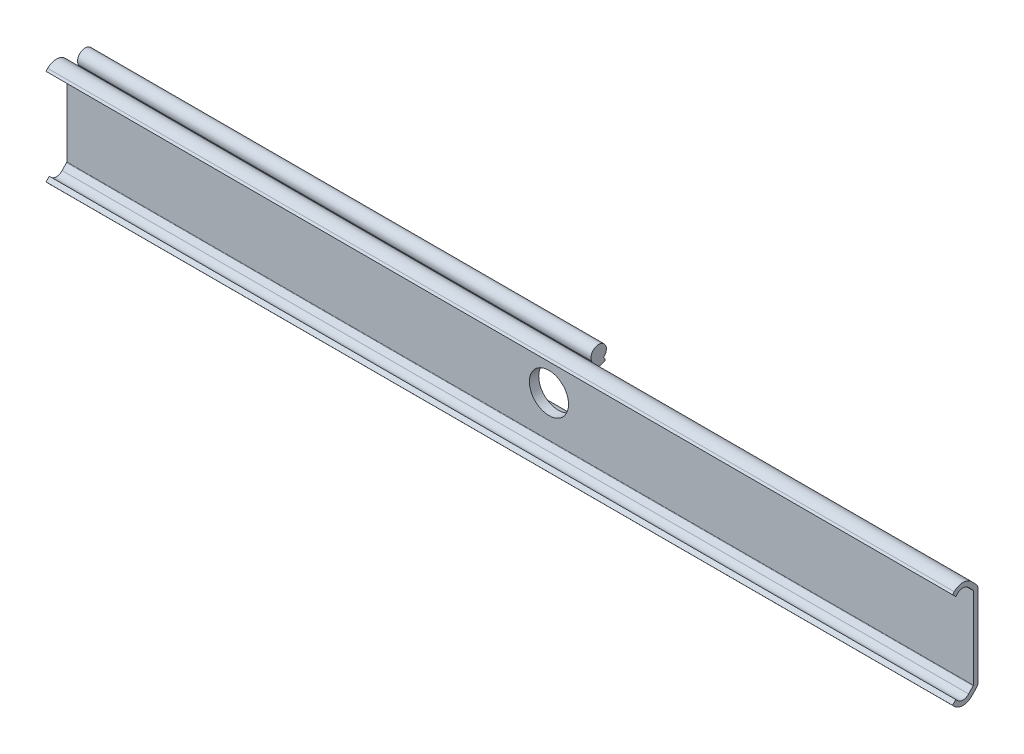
ISO-10303-21;
HEADER;
FILE_DESCRIPTION(('STEP AP214'),'2;1');
FILE_NAME('part.step','',(''),(''),'','','');
FILE_SCHEMA(('AUTOMOTIVE_DESIGN { 1 0 10303 214 1 1 1 1 }'));
ENDSEC;
DATA;
#1=APPLICATION_CONTEXT('core data for automotive mechanical design processes');
#2=APPLICATION_PROTOCOL_DEFINITION('international standard','automotive_design',2000,#1);
#3=PRODUCT_CONTEXT('',#1,'mechanical');
#4=PRODUCT('Part','Part','',(#3));
#5=PRODUCT_RELATED_PRODUCT_CATEGORY('part','',(#4));
#6=PRODUCT_DEFINITION_FORMATION('','',#4);
#7=PRODUCT_DEFINITION_CONTEXT('part definition',#1,'design');
#8=PRODUCT_DEFINITION('design','',#6,#7);
#9=PRODUCT_DEFINITION_SHAPE('','',#8);
#10=(LENGTH_UNIT() NAMED_UNIT(*) SI_UNIT(.MILLI.,.METRE.));
#11=(NAMED_UNIT(*) PLANE_ANGLE_UNIT() SI_UNIT($,.RADIAN.));
#12=(NAMED_UNIT(*) SI_UNIT($,.STERADIAN.) SOLID_ANGLE_UNIT());
#13=UNCERTAINTY_MEASURE_WITH_UNIT(LENGTH_MEASURE(1.E-05),#10,'distance_accuracy_value','');
#14=(GEOMETRIC_REPRESENTATION_CONTEXT(3) GLOBAL_UNCERTAINTY_ASSIGNED_CONTEXT((#13)) GLOBAL_UNIT_ASSIGNED_CONTEXT((#10,
#11,#12)) REPRESENTATION_CONTEXT('',''));
#15=CARTESIAN_POINT('',(0.,0.,0.));
#16=DIRECTION('',(0.,0.,1.));
#17=DIRECTION('',(1.,0.,0.));
#18=AXIS2_PLACEMENT_3D('',#15,#16,#17);
#19=CARTESIAN_POINT('',(300.8,13.561018,0.));
#20=DIRECTION('',(0.,0.,-1.));
#21=DIRECTION('',(-1.,0.,0.));
#22=AXIS2_PLACEMENT_3D('',#19,#20,#21);
#23=PLANE('',#22);
#24=DIRECTION('',(0.,-1.,0.));
#25=VECTOR('',#24,1.);
#26=CARTESIAN_POINT('',(0.,13.561018,0.));
#27=LINE('',#26,#25);
#28=CARTESIAN_POINT('',(0.,-10.7622239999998,0.));
#29=VERTEX_POINT('',#28);
#30=CARTESIAN_POINT('',(0.,-13.561018,0.));
#31=VERTEX_POINT('',#30);
#32=EDGE_CURVE('E379',#29,#31,#27,.T.);
#33=ORIENTED_EDGE('',*,*,#32,.F.);
#34=DIRECTION('',(-1.,0.,0.));
#35=VECTOR('',#34,1.);
#36=CARTESIAN_POINT('',(301.484940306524,-10.7622239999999,0.));
#37=LINE('',#36,#35);
#38=CARTESIAN_POINT('',(170.4,-10.7622239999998,0.));
#39=VERTEX_POINT('',#38);
#40=EDGE_CURVE('E34',#39,#29,#37,.T.);
#41=ORIENTED_EDGE('',*,*,#40,.F.);
#42=DIRECTION('',(0.,-1.,0.));
#43=VECTOR('',#42,1.);
#44=CARTESIAN_POINT('',(170.4,25.,0.));
#45=LINE('',#44,#43);
#46=CARTESIAN_POINT('',(170.4,10.7622239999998,0.));
#47=VERTEX_POINT('',#46);
#48=EDGE_CURVE('E280',#47,#39,#45,.T.);
#49=ORIENTED_EDGE('',*,*,#48,.F.);
#50=DIRECTION('',(-1.,0.,0.));
#51=VECTOR('',#50,1.);
#52=CARTESIAN_POINT('',(301.484940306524,10.7622239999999,0.));
#53=LINE('',#52,#51);
#54=CARTESIAN_POINT('',(0.,10.7622239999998,0.));
#55=VERTEX_POINT('',#54);
#56=EDGE_CURVE('E26',#47,#55,#53,.T.);
#57=ORIENTED_EDGE('',*,*,#56,.T.);
#58=CARTESIAN_POINT('',(0.,13.561018,0.));
#59=VERTEX_POINT('',#58);
#60=EDGE_CURVE('E261',#59,#55,#27,.T.);
#61=ORIENTED_EDGE('',*,*,#60,.F.);
#62=DIRECTION('',(-1.,0.,0.));
#63=VECTOR('',#62,1.);
#64=CARTESIAN_POINT('',(300.8,13.561018,0.));
#65=LINE('',#64,#63);
#66=CARTESIAN_POINT('',(300.8,13.561018,0.));
#67=VERTEX_POINT('',#66);
#68=EDGE_CURVE('E450',#67,#59,#65,.T.);
#69=ORIENTED_EDGE('',*,*,#68,.F.);
#70=DIRECTION('',(0.,1.,0.));
#71=VECTOR('',#70,1.);
#72=CARTESIAN_POINT('',(300.8,-10.7622239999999,0.));
#73=LINE('',#72,#71);
#74=CARTESIAN_POINT('',(300.8,-13.561018,0.));
#75=VERTEX_POINT('',#74);
#76=EDGE_CURVE('E10',#75,#67,#73,.T.);
#77=ORIENTED_EDGE('',*,*,#76,.F.);
#78=DIRECTION('',(-1.,0.,0.));
#79=VECTOR('',#78,1.);
#80=CARTESIAN_POINT('',(300.8,-13.561018,0.));
#81=LINE('',#80,#79);
#82=EDGE_CURVE('E447',#75,#31,#81,.T.);
#83=ORIENTED_EDGE('',*,*,#82,.T.);
#84=EDGE_LOOP('',(#33,#41,#49,#57,#61,#69,#77,#83));
#85=FACE_BOUND('',#84,.T.);
#86=ADVANCED_FACE('F17',(#85),#23,.T.);
#87=CARTESIAN_POINT('',(301.484940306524,10.7622239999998,-1.66));
#88=DIRECTION('',(-1.,0.,0.));
#89=DIRECTION('',(0.,0.,1.));
#90=AXIS2_PLACEMENT_3D('',#87,#88,#89);
#91=CYLINDRICAL_SURFACE('',#90,1.66);
#92=DIRECTION('',(-1.,0.,0.));
#93=VECTOR('',#92,1.);
#94=CARTESIAN_POINT('',(97.9924701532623,12.2669175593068,-2.36106867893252));
#95=LINE('',#94,#93);
#96=CARTESIAN_POINT('',(0.,12.2669175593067,-2.36106867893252));
#97=VERTEX_POINT('',#96);
#98=CARTESIAN_POINT('',(170.4,12.2669175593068,-2.36106867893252));
#99=VERTEX_POINT('',#98);
#100=EDGE_CURVE('E242',#97,#99,#95,.F.);
#101=ORIENTED_EDGE('',*,*,#100,.F.);
#102=CARTESIAN_POINT('',(0.,10.7622239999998,-1.66));
#103=DIRECTION('',(1.,0.,0.));
#104=DIRECTION('',(0.,0.,-1.));
#105=AXIS2_PLACEMENT_3D('',#102,#103,#104);
#106=CIRCLE('',#105,1.66);
#107=EDGE_CURVE('E245',#97,#55,#106,.T.);
#108=ORIENTED_EDGE('',*,*,#107,.T.);
#109=ORIENTED_EDGE('',*,*,#56,.F.);
#110=CARTESIAN_POINT('',(170.4,10.7622239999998,-1.66));
#111=DIRECTION('',(-1.,0.,0.));
#112=DIRECTION('',(0.,0.,-1.));
#113=AXIS2_PLACEMENT_3D('',#110,#111,#112);
#114=CIRCLE('',#113,1.66);
#115=EDGE_CURVE('E246',#99,#47,#114,.F.);
#116=ORIENTED_EDGE('',*,*,#115,.F.);
#117=EDGE_LOOP('',(#101,#108,#109,#116));
#118=FACE_BOUND('',#117,.T.);
#119=ADVANCED_FACE('F244',(#118),#91,.T.);
#120=CARTESIAN_POINT('',(301.484940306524,-10.7622239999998,-1.66));
#121=DIRECTION('',(-1.,0.,0.));
#122=DIRECTION('',(0.,0.,1.));
#123=AXIS2_PLACEMENT_3D('',#120,#121,#122);
#124=CYLINDRICAL_SURFACE('',#123,1.66);
#125=DIRECTION('',(-1.,0.,0.));
#126=VECTOR('',#125,1.);
#127=CARTESIAN_POINT('',(97.9924701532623,-12.2669175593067,-2.36106867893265));
#128=LINE('',#127,#126);
#129=CARTESIAN_POINT('',(170.4,-12.2669175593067,-2.36106867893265));
#130=VERTEX_POINT('',#129);
#131=CARTESIAN_POINT('',(0.,-12.2669175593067,-2.36106867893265));
#132=VERTEX_POINT('',#131);
#133=EDGE_CURVE('E278',#130,#132,#128,.T.);
#134=ORIENTED_EDGE('',*,*,#133,.F.);
#135=CARTESIAN_POINT('',(170.4,-10.7622239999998,-1.66));
#136=DIRECTION('',(-1.,0.,0.));
#137=DIRECTION('',(0.,0.,-1.));
#138=AXIS2_PLACEMENT_3D('',#135,#136,#137);
#139=CIRCLE('',#138,1.66);
#140=EDGE_CURVE('E301',#39,#130,#139,.F.);
#141=ORIENTED_EDGE('',*,*,#140,.F.);
#142=ORIENTED_EDGE('',*,*,#40,.T.);
#143=CARTESIAN_POINT('',(0.,-10.7622239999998,-1.66));
#144=DIRECTION('',(1.,0.,0.));
#145=DIRECTION('',(0.,0.,-1.));
#146=AXIS2_PLACEMENT_3D('',#143,#144,#145);
#147=CIRCLE('',#146,1.66);
#148=EDGE_CURVE('E891',#29,#132,#147,.T.);
#149=ORIENTED_EDGE('',*,*,#148,.T.);
#150=EDGE_LOOP('',(#134,#141,#142,#149));
#151=FACE_BOUND('',#150,.T.);
#152=ADVANCED_FACE('F563',(#151),#124,.T.);
#153=CARTESIAN_POINT('',(301.484940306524,-11.8784795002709,-5.9846283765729));
#154=DIRECTION('',(0.,-0.60181512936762,-0.798635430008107));
#155=DIRECTION('',(0.,-0.798635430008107,0.60181512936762));
#156=AXIS2_PLACEMENT_3D('',#153,#154,#155);
#157=PLANE('',#156);
#158=DIRECTION('',(-1.,0.,0.));
#159=VECTOR('',#158,1.);
#160=CARTESIAN_POINT('',(177.612489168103,-11.6159967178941,-6.1824233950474));
#161=LINE('',#160,#159);
#162=CARTESIAN_POINT('',(0.,-11.6159967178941,-6.18242339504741));
#163=VERTEX_POINT('',#162);
#164=CARTESIAN_POINT('',(170.4,-11.6159967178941,-6.1824233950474));
#165=VERTEX_POINT('',#164);
#166=EDGE_CURVE('E275',#163,#165,#161,.F.);
#167=ORIENTED_EDGE('',*,*,#166,.F.);
#168=DIRECTION('',(0.,0.798635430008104,-0.601815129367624));
#169=VECTOR('',#168,1.);
#170=CARTESIAN_POINT('',(0.,-11.0618539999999,-6.6));
#171=LINE('',#170,#169);
#172=CARTESIAN_POINT('',(0.,-11.0618539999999,-6.6));
#173=VERTEX_POINT('',#172);
#174=EDGE_CURVE('E918',#163,#173,#171,.T.);
#175=ORIENTED_EDGE('',*,*,#174,.T.);
#176=DIRECTION('',(-1.,0.,0.));
#177=VECTOR('',#176,1.);
#178=CARTESIAN_POINT('',(301.484940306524,-11.0618539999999,-6.6));
#179=LINE('',#178,#177);
#180=CARTESIAN_POINT('',(170.4,-11.0618539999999,-6.6));
#181=VERTEX_POINT('',#180);
#182=EDGE_CURVE('E314',#181,#173,#179,.T.);
#183=ORIENTED_EDGE('',*,*,#182,.F.);
#184=DIRECTION('',(0.,0.798635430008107,-0.60181512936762));
#185=VECTOR('',#184,1.);
#186=CARTESIAN_POINT('',(170.4,-11.8784795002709,-5.9846283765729));
#187=LINE('',#186,#185);
#188=EDGE_CURVE('E299',#165,#181,#187,.T.);
#189=ORIENTED_EDGE('',*,*,#188,.F.);
#190=EDGE_LOOP('',(#167,#175,#183,#189));
#191=FACE_BOUND('',#190,.T.);
#192=ADVANCED_FACE('F649',(#191),#157,.T.);
#193=CARTESIAN_POINT('',(301.484940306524,-11.0618539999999,-6.6));
#194=DIRECTION('',(0.,0.,-1.));
#195=DIRECTION('',(-1.,0.,0.));
#196=AXIS2_PLACEMENT_3D('',#193,#194,#195);
#197=PLANE('',#196);
#198=DIRECTION('',(0.,1.,0.));
#199=VECTOR('',#198,1.);
#200=CARTESIAN_POINT('',(170.4,-11.0618539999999,-6.6));
#201=LINE('',#200,#199);
#202=CARTESIAN_POINT('',(170.4,-10.4239399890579,-6.6));
#203=VERTEX_POINT('',#202);
#204=EDGE_CURVE('E297',#181,#203,#201,.T.);
#205=ORIENTED_EDGE('',*,*,#204,.F.);
#206=ORIENTED_EDGE('',*,*,#182,.T.);
#207=DIRECTION('',(0.,1.,0.));
#208=VECTOR('',#207,1.);
#209=CARTESIAN_POINT('',(0.,-10.4239399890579,-6.6));
#210=LINE('',#209,#208);
#211=CARTESIAN_POINT('',(0.,-10.4239399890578,-6.6));
#212=VERTEX_POINT('',#211);
#213=EDGE_CURVE('E915',#173,#212,#210,.T.);
#214=ORIENTED_EDGE('',*,*,#213,.T.);
#215=DIRECTION('',(-1.,0.,0.));
#216=VECTOR('',#215,1.);
#217=CARTESIAN_POINT('',(301.484940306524,-10.4239399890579,-6.6));
#218=LINE('',#217,#216);
#219=EDGE_CURVE('E316',#203,#212,#218,.T.);
#220=ORIENTED_EDGE('',*,*,#219,.F.);
#221=EDGE_LOOP('',(#205,#206,#214,#220));
#222=FACE_BOUND('',#221,.T.);
#223=ADVANCED_FACE('F645',(#222),#197,.T.);
#224=CARTESIAN_POINT('',(301.484940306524,-13.915,-4.44999999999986));
#225=DIRECTION('',(-1.,0.,0.));
#226=DIRECTION('',(0.,0.,1.));
#227=AXIS2_PLACEMENT_3D('',#224,#225,#226);
#228=CYLINDRICAL_SURFACE('',#227,4.1);
#229=CARTESIAN_POINT('',(170.4,-13.915,-4.44999999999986));
#230=DIRECTION('',(-1.,0.,0.));
#231=DIRECTION('',(0.,0.,-1.));
#232=AXIS2_PLACEMENT_3D('',#229,#230,#231);
#233=CIRCLE('',#232,4.1);
#234=CARTESIAN_POINT('',(170.4,-10.8444026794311,-1.73312089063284));
#235=VERTEX_POINT('',#234);
#236=EDGE_CURVE('E295',#203,#235,#233,.F.);
#237=ORIENTED_EDGE('',*,*,#236,.F.);
#238=ORIENTED_EDGE('',*,*,#219,.T.);
#239=CARTESIAN_POINT('',(0.,-13.915,-4.44999999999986));
#240=DIRECTION('',(1.,0.,0.));
#241=DIRECTION('',(0.,0.,-1.));
#242=AXIS2_PLACEMENT_3D('',#239,#240,#241);
#243=CIRCLE('',#242,4.1);
#244=CARTESIAN_POINT('',(0.,-10.8444026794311,-1.73312089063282));
#245=VERTEX_POINT('',#244);
#246=EDGE_CURVE('E912',#212,#245,#243,.T.);
#247=ORIENTED_EDGE('',*,*,#246,.T.);
#248=DIRECTION('',(-1.,0.,0.));
#249=VECTOR('',#248,1.);
#250=CARTESIAN_POINT('',(301.484940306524,-10.8444026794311,-1.73312089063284));
#251=LINE('',#250,#249);
#252=EDGE_CURVE('E318',#235,#245,#251,.T.);
#253=ORIENTED_EDGE('',*,*,#252,.F.);
#254=EDGE_LOOP('',(#237,#238,#247,#253));
#255=FACE_BOUND('',#254,.T.);
#256=ADVANCED_FACE('F641',(#255),#228,.T.);
#257=CARTESIAN_POINT('',(301.484940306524,-10.7622239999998,-1.66));
#258=DIRECTION('',(-1.,0.,0.));
#259=DIRECTION('',(0.,0.,1.));
#260=AXIS2_PLACEMENT_3D('',#257,#258,#259);
#261=CYLINDRICAL_SURFACE('',#260,0.110000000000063);
#262=CARTESIAN_POINT('',(170.4,-10.7622239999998,-1.66));
#263=DIRECTION('',(-1.,0.,0.));
#264=DIRECTION('',(0.,0.,-1.));
#265=AXIS2_PLACEMENT_3D('',#262,#263,#264);
#266=CIRCLE('',#265,0.110000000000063);
#267=CARTESIAN_POINT('',(170.4,-10.7622239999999,-1.55));
#268=VERTEX_POINT('',#267);
#269=EDGE_CURVE('E293',#235,#268,#266,.T.);
#270=ORIENTED_EDGE('',*,*,#269,.F.);
#271=ORIENTED_EDGE('',*,*,#252,.T.);
#272=CARTESIAN_POINT('',(0.,-10.7622239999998,-1.66));
#273=DIRECTION('',(1.,0.,0.));
#274=DIRECTION('',(0.,0.,-1.));
#275=AXIS2_PLACEMENT_3D('',#272,#273,#274);
#276=CIRCLE('',#275,0.110000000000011);
#277=CARTESIAN_POINT('',(0.,-10.7622239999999,-1.55));
#278=VERTEX_POINT('',#277);
#279=EDGE_CURVE('E909',#245,#278,#276,.F.);
#280=ORIENTED_EDGE('',*,*,#279,.T.);
#281=DIRECTION('',(-1.,0.,0.));
#282=VECTOR('',#281,1.);
#283=CARTESIAN_POINT('',(301.484940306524,-10.7622239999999,-1.55));
#284=LINE('',#283,#282);
#285=EDGE_CURVE('E320',#268,#278,#284,.T.);
#286=ORIENTED_EDGE('',*,*,#285,.F.);
#287=EDGE_LOOP('',(#270,#271,#280,#286));
#288=FACE_BOUND('',#287,.T.);
#289=ADVANCED_FACE('F637',(#288),#261,.F.);
#290=CARTESIAN_POINT('',(301.484940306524,10.7622239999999,-1.55));
#291=DIRECTION('',(0.,0.,-1.));
#292=DIRECTION('',(-1.,0.,0.));
#293=AXIS2_PLACEMENT_3D('',#290,#291,#292);
#294=PLANE('',#293);
#295=DIRECTION('',(0.,1.,0.));
#296=VECTOR('',#295,1.);
#297=CARTESIAN_POINT('',(170.4,10.7622239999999,-1.55));
#298=LINE('',#297,#296);
#299=CARTESIAN_POINT('',(170.4,10.7622239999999,-1.54999999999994));
#300=VERTEX_POINT('',#299);
#301=EDGE_CURVE('E291',#268,#300,#298,.T.);
#302=ORIENTED_EDGE('',*,*,#301,.F.);
#303=ORIENTED_EDGE('',*,*,#285,.T.);
#304=DIRECTION('',(0.,1.,0.));
#305=VECTOR('',#304,1.);
#306=CARTESIAN_POINT('',(0.,10.7622239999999,-1.55));
#307=LINE('',#306,#305);
#308=CARTESIAN_POINT('',(0.,10.7622239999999,-1.55));
#309=VERTEX_POINT('',#308);
#310=EDGE_CURVE('E906',#278,#309,#307,.T.);
#311=ORIENTED_EDGE('',*,*,#310,.T.);
#312=DIRECTION('',(-1.,0.,0.));
#313=VECTOR('',#312,1.);
#314=CARTESIAN_POINT('',(301.484940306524,10.7622239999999,-1.55));
#315=LINE('',#314,#313);
#316=EDGE_CURVE('E322',#300,#309,#315,.T.);
#317=ORIENTED_EDGE('',*,*,#316,.F.);
#318=EDGE_LOOP('',(#302,#303,#311,#317));
#319=FACE_BOUND('',#318,.T.);
#320=CARTESIAN_POINT('',(159.984940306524,0.,-1.55));
#321=DIRECTION('',(0.,0.,-1.));
#322=DIRECTION('',(0.,-1.,0.));
#323=AXIS2_PLACEMENT_3D('',#320,#321,#322);
#324=CIRCLE('',#323,6.5);
#325=CARTESIAN_POINT('',(159.984940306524,-6.49999999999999,-1.55));
#326=VERTEX_POINT('',#325);
#327=EDGE_CURVE('E305',#326,#326,#324,.T.);
#328=ORIENTED_EDGE('',*,*,#327,.F.);
#329=EDGE_LOOP('',(#328));
#330=FACE_BOUND('',#329,.T.);
#331=ADVANCED_FACE('F633',(#319,#330),#294,.T.);
#332=CARTESIAN_POINT('',(301.484940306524,10.7622239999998,-1.66));
#333=DIRECTION('',(-1.,0.,0.));
#334=DIRECTION('',(0.,0.,1.));
#335=AXIS2_PLACEMENT_3D('',#332,#333,#334);
#336=CYLINDRICAL_SURFACE('',#335,0.110000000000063);
#337=CARTESIAN_POINT('',(170.4,10.7622239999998,-1.66));
#338=DIRECTION('',(-1.,0.,0.));
#339=DIRECTION('',(0.,0.,-1.));
#340=AXIS2_PLACEMENT_3D('',#337,#338,#339);
#341=CIRCLE('',#340,0.110000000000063);
#342=CARTESIAN_POINT('',(170.4,10.8444026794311,-1.73312089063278));
#343=VERTEX_POINT('',#342);
#344=EDGE_CURVE('E289',#300,#343,#341,.T.);
#345=ORIENTED_EDGE('',*,*,#344,.F.);
#346=ORIENTED_EDGE('',*,*,#316,.T.);
#347=CARTESIAN_POINT('',(0.,10.7622239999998,-1.66));
#348=DIRECTION('',(1.,0.,0.));
#349=DIRECTION('',(0.,0.,-1.));
#350=AXIS2_PLACEMENT_3D('',#347,#348,#349);
#351=CIRCLE('',#350,0.110000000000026);
#352=CARTESIAN_POINT('',(0.,10.8444026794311,-1.73312089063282));
#353=VERTEX_POINT('',#352);
#354=EDGE_CURVE('E901',#309,#353,#351,.F.);
#355=ORIENTED_EDGE('',*,*,#354,.T.);
#356=DIRECTION('',(-1.,0.,0.));
#357=VECTOR('',#356,1.);
#358=CARTESIAN_POINT('',(301.484940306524,10.8444026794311,-1.73312089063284));
#359=LINE('',#358,#357);
#360=EDGE_CURVE('E324',#343,#353,#359,.T.);
#361=ORIENTED_EDGE('',*,*,#360,.F.);
#362=EDGE_LOOP('',(#345,#346,#355,#361));
#363=FACE_BOUND('',#362,.T.);
#364=ADVANCED_FACE('F629',(#363),#336,.F.);
#365=CARTESIAN_POINT('',(301.484940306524,13.915,-4.44999999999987));
#366=DIRECTION('',(-1.,0.,0.));
#367=DIRECTION('',(0.,0.,1.));
#368=AXIS2_PLACEMENT_3D('',#365,#366,#367);
#369=CYLINDRICAL_SURFACE('',#368,4.1);
#370=CARTESIAN_POINT('',(170.4,13.915,-4.44999999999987));
#371=DIRECTION('',(-1.,0.,0.));
#372=DIRECTION('',(0.,0.,-1.));
#373=AXIS2_PLACEMENT_3D('',#370,#371,#372);
#374=CIRCLE('',#373,4.1);
#375=CARTESIAN_POINT('',(170.4,10.4239399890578,-6.6));
#376=VERTEX_POINT('',#375);
#377=EDGE_CURVE('E287',#343,#376,#374,.F.);
#378=ORIENTED_EDGE('',*,*,#377,.F.);
#379=ORIENTED_EDGE('',*,*,#360,.T.);
#380=CARTESIAN_POINT('',(0.,13.915,-4.44999999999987));
#381=DIRECTION('',(1.,0.,0.));
#382=DIRECTION('',(0.,0.,-1.));
#383=AXIS2_PLACEMENT_3D('',#380,#381,#382);
#384=CIRCLE('',#383,4.1);
#385=CARTESIAN_POINT('',(0.,10.4239399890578,-6.6));
#386=VERTEX_POINT('',#385);
#387=EDGE_CURVE('E900',#353,#386,#384,.T.);
#388=ORIENTED_EDGE('',*,*,#387,.T.);
#389=DIRECTION('',(-1.,0.,0.));
#390=VECTOR('',#389,1.);
#391=CARTESIAN_POINT('',(301.484940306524,10.4239399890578,-6.6));
#392=LINE('',#391,#390);
#393=EDGE_CURVE('E326',#376,#386,#392,.T.);
#394=ORIENTED_EDGE('',*,*,#393,.F.);
#395=EDGE_LOOP('',(#378,#379,#388,#394));
#396=FACE_BOUND('',#395,.T.);
#397=ADVANCED_FACE('F625',(#396),#369,.T.);
#398=CARTESIAN_POINT('',(301.484940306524,11.0618539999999,-6.6));
#399=DIRECTION('',(0.,0.,-1.));
#400=DIRECTION('',(-1.,0.,0.));
#401=AXIS2_PLACEMENT_3D('',#398,#399,#400);
#402=PLANE('',#401);
#403=DIRECTION('',(0.,1.,0.));
#404=VECTOR('',#403,1.);
#405=CARTESIAN_POINT('',(170.4,11.0618539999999,-6.6));
#406=LINE('',#405,#404);
#407=CARTESIAN_POINT('',(170.4,11.0618539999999,-6.6));
#408=VERTEX_POINT('',#407);
#409=EDGE_CURVE('E285',#376,#408,#406,.T.);
#410=ORIENTED_EDGE('',*,*,#409,.F.);
#411=ORIENTED_EDGE('',*,*,#393,.T.);
#412=DIRECTION('',(0.,1.,0.));
#413=VECTOR('',#412,1.);
#414=CARTESIAN_POINT('',(0.,11.0618539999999,-6.6));
#415=LINE('',#414,#413);
#416=CARTESIAN_POINT('',(0.,11.0618539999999,-6.6));
#417=VERTEX_POINT('',#416);
#418=EDGE_CURVE('E268',#386,#417,#415,.T.);
#419=ORIENTED_EDGE('',*,*,#418,.T.);
#420=DIRECTION('',(-1.,0.,0.));
#421=VECTOR('',#420,1.);
#422=CARTESIAN_POINT('',(301.484940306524,11.0618539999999,-6.6));
#423=LINE('',#422,#421);
#424=EDGE_CURVE('E328',#408,#417,#423,.T.);
#425=ORIENTED_EDGE('',*,*,#424,.F.);
#426=EDGE_LOOP('',(#410,#411,#419,#425));
#427=FACE_BOUND('',#426,.T.);
#428=ADVANCED_FACE('F604',(#427),#402,.T.);
#429=CARTESIAN_POINT('',(301.484940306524,11.8784795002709,-5.98462837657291));
#430=DIRECTION('',(0.,0.60181512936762,-0.798635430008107));
#431=DIRECTION('',(0.,-0.798635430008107,-0.60181512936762));
#432=AXIS2_PLACEMENT_3D('',#429,#430,#431);
#433=PLANE('',#432);
#434=DIRECTION('',(-1.,0.,0.));
#435=VECTOR('',#434,1.);
#436=CARTESIAN_POINT('',(177.612489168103,11.615996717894,-6.18242339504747));
#437=LINE('',#436,#435);
#438=CARTESIAN_POINT('',(170.4,11.615996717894,-6.18242339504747));
#439=VERTEX_POINT('',#438);
#440=CARTESIAN_POINT('',(0.,11.615996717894,-6.18242339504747));
#441=VERTEX_POINT('',#440);
#442=EDGE_CURVE('E251',#439,#441,#437,.T.);
#443=ORIENTED_EDGE('',*,*,#442,.F.);
#444=DIRECTION('',(0.,0.798635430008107,0.60181512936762));
#445=VECTOR('',#444,1.);
#446=CARTESIAN_POINT('',(170.4,11.8784795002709,-5.98462837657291));
#447=LINE('',#446,#445);
#448=EDGE_CURVE('E282',#408,#439,#447,.T.);
#449=ORIENTED_EDGE('',*,*,#448,.F.);
#450=ORIENTED_EDGE('',*,*,#424,.T.);
#451=DIRECTION('',(0.,0.798635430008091,0.601815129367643));
#452=VECTOR('',#451,1.);
#453=CARTESIAN_POINT('',(0.,11.615996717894,-6.18242339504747));
#454=LINE('',#453,#452);
#455=EDGE_CURVE('E266',#417,#441,#454,.T.);
#456=ORIENTED_EDGE('',*,*,#455,.T.);
#457=EDGE_LOOP('',(#443,#449,#450,#456));
#458=FACE_BOUND('',#457,.T.);
#459=ADVANCED_FACE('F600',(#458),#433,.T.);
#460=CARTESIAN_POINT('',(300.8,-15.8897090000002,8.46));
#461=DIRECTION('',(0.,-0.692409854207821,0.721504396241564));
#462=DIRECTION('',(0.,0.721504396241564,0.692409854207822));
#463=AXIS2_PLACEMENT_3D('',#460,#461,#462);
#464=PLANE('',#463);
#465=DIRECTION('',(0.,0.721504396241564,0.692409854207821));
#466=VECTOR('',#465,1.);
#467=CARTESIAN_POINT('',(0.,-15.8897090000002,8.46));
#468=LINE('',#467,#466);
#469=CARTESIAN_POINT('',(0.,-16.4741282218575,7.89914738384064));
#470=VERTEX_POINT('',#469);
#471=CARTESIAN_POINT('',(0.,-15.8897090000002,8.46));
#472=VERTEX_POINT('',#471);
#473=EDGE_CURVE('E332',#470,#472,#468,.T.);
#474=ORIENTED_EDGE('',*,*,#473,.F.);
#475=DIRECTION('',(-1.,0.,0.));
#476=VECTOR('',#475,1.);
#477=CARTESIAN_POINT('',(300.8,-16.4741282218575,7.89914738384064));
#478=LINE('',#477,#476);
#479=CARTESIAN_POINT('',(300.8,-16.4741282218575,7.89914738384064));
#480=VERTEX_POINT('',#479);
#481=EDGE_CURVE('E21',#480,#470,#478,.T.);
#482=ORIENTED_EDGE('',*,*,#481,.F.);
#483=DIRECTION('',(0.,0.721504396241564,0.692409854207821));
#484=VECTOR('',#483,1.);
#485=CARTESIAN_POINT('',(300.8,-15.8897090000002,8.46));
#486=LINE('',#485,#484);
#487=CARTESIAN_POINT('',(300.8,-15.8897090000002,8.46));
#488=VERTEX_POINT('',#487);
#489=EDGE_CURVE('E390',#480,#488,#486,.T.);
#490=ORIENTED_EDGE('',*,*,#489,.T.);
#491=DIRECTION('',(-1.,0.,0.));
#492=VECTOR('',#491,1.);
#493=CARTESIAN_POINT('',(300.8,-15.8897090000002,8.46));
#494=LINE('',#493,#492);
#495=EDGE_CURVE('E479',#488,#472,#494,.T.);
#496=ORIENTED_EDGE('',*,*,#495,.T.);
#497=EDGE_LOOP('',(#474,#482,#490,#496));
#498=FACE_BOUND('',#497,.T.);
#499=ADVANCED_FACE('F487',(#498),#464,.T.);
#500=CARTESIAN_POINT('',(300.8,-14.7934620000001,7.363752));
#501=DIRECTION('',(0.,0.707107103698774,0.707106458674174));
#502=DIRECTION('',(0.,0.707106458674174,-0.707107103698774));
#503=AXIS2_PLACEMENT_3D('',#500,#501,#502);
#504=PLANE('',#503);
#505=DIRECTION('',(0.,0.707106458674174,-0.707107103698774));
#506=VECTOR('',#505,1.);
#507=CARTESIAN_POINT('',(0.,-14.7934620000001,7.363752));
#508=LINE('',#507,#506);
#509=CARTESIAN_POINT('',(0.,-14.7934620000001,7.363752));
#510=VERTEX_POINT('',#509);
#511=EDGE_CURVE('E335',#472,#510,#508,.T.);
#512=ORIENTED_EDGE('',*,*,#511,.F.);
#513=ORIENTED_EDGE('',*,*,#495,.F.);
#514=DIRECTION('',(0.,0.707106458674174,-0.707107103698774));
#515=VECTOR('',#514,1.);
#516=CARTESIAN_POINT('',(300.8,-14.7934620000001,7.363752));
#517=LINE('',#516,#515);
#518=CARTESIAN_POINT('',(300.8,-14.7934620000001,7.363752));
#519=VERTEX_POINT('',#518);
#520=EDGE_CURVE('E393',#488,#519,#517,.T.);
#521=ORIENTED_EDGE('',*,*,#520,.T.);
#522=DIRECTION('',(-1.,0.,0.));
#523=VECTOR('',#522,1.);
#524=CARTESIAN_POINT('',(300.8,-14.7934620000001,7.363752));
#525=LINE('',#524,#523);
#526=EDGE_CURVE('E478',#519,#510,#525,.T.);
#527=ORIENTED_EDGE('',*,*,#526,.T.);
#528=EDGE_LOOP('',(#512,#513,#521,#527));
#529=FACE_BOUND('',#528,.T.);
#530=ADVANCED_FACE('F500',(#529),#504,.T.);
#531=CARTESIAN_POINT('',(300.8,-15.3880487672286,6.79314086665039));
#532=DIRECTION('',(0.,0.692410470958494,-0.721503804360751));
#533=DIRECTION('',(0.,-0.721503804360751,-0.692410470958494));
#534=AXIS2_PLACEMENT_3D('',#531,#532,#533);
#535=PLANE('',#534);
#536=DIRECTION('',(0.,-0.721503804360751,-0.692410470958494));
#537=VECTOR('',#536,1.);
#538=CARTESIAN_POINT('',(0.,-15.3880487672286,6.79314086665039));
#539=LINE('',#538,#537);
#540=CARTESIAN_POINT('',(0.,-15.3880487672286,6.79314086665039));
#541=VERTEX_POINT('',#540);
#542=EDGE_CURVE('E338',#510,#541,#539,.T.);
#543=ORIENTED_EDGE('',*,*,#542,.F.);
#544=ORIENTED_EDGE('',*,*,#526,.F.);
#545=DIRECTION('',(0.,-0.721503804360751,-0.692410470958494));
#546=VECTOR('',#545,1.);
#547=CARTESIAN_POINT('',(300.8,-15.3880487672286,6.79314086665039));
#548=LINE('',#547,#546);
#549=CARTESIAN_POINT('',(300.8,-15.3880487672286,6.79314086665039));
#550=VERTEX_POINT('',#549);
#551=EDGE_CURVE('E396',#519,#550,#548,.T.);
#552=ORIENTED_EDGE('',*,*,#551,.T.);
#553=DIRECTION('',(-1.,0.,0.));
#554=VECTOR('',#553,1.);
#555=CARTESIAN_POINT('',(300.8,-15.3880487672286,6.79314086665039));
#556=LINE('',#555,#554);
#557=EDGE_CURVE('E476',#550,#541,#556,.T.);
#558=ORIENTED_EDGE('',*,*,#557,.T.);
#559=EDGE_LOOP('',(#543,#544,#552,#558));
#560=FACE_BOUND('',#559,.T.);
#561=ADVANCED_FACE('F504',(#560),#535,.T.);
#562=CARTESIAN_POINT('',(300.8,-13.575,5.));
#563=DIRECTION('',(-1.,0.,0.));
#564=DIRECTION('',(0.,0.,1.));
#565=AXIS2_PLACEMENT_3D('',#562,#563,#564);
#566=CYLINDRICAL_SURFACE('',#565,2.55);
#567=CARTESIAN_POINT('',(0.,-13.575,5.));
#568=DIRECTION('',(1.,0.,0.));
#569=DIRECTION('',(0.,0.,1.));
#570=AXIS2_PLACEMENT_3D('',#567,#568,#569);
#571=CIRCLE('',#570,2.55);
#572=CARTESIAN_POINT('',(0.,-15.2920682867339,3.11474762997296));
#573=VERTEX_POINT('',#572);
#574=EDGE_CURVE('E341',#541,#573,#571,.T.);
#575=ORIENTED_EDGE('',*,*,#574,.F.);
#576=ORIENTED_EDGE('',*,*,#557,.F.);
#577=CARTESIAN_POINT('',(300.8,-13.575,5.));
#578=DIRECTION('',(1.,0.,0.));
#579=DIRECTION('',(0.,0.,1.));
#580=AXIS2_PLACEMENT_3D('',#577,#578,#579);
#581=CIRCLE('',#580,2.55);
#582=CARTESIAN_POINT('',(300.8,-15.2920682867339,3.11474762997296));
#583=VERTEX_POINT('',#582);
#584=EDGE_CURVE('E399',#550,#583,#581,.T.);
#585=ORIENTED_EDGE('',*,*,#584,.T.);
#586=DIRECTION('',(-1.,0.,0.));
#587=VECTOR('',#586,1.);
#588=CARTESIAN_POINT('',(300.8,-15.2920682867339,3.11474762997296));
#589=LINE('',#588,#587);
#590=EDGE_CURVE('E474',#583,#573,#589,.T.);
#591=ORIENTED_EDGE('',*,*,#590,.T.);
#592=EDGE_LOOP('',(#575,#576,#585,#591));
#593=FACE_BOUND('',#592,.T.);
#594=ADVANCED_FACE('F506',(#593),#566,.F.);
#595=CARTESIAN_POINT('',(300.8,-13.7341205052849,1.61962394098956));
#596=DIRECTION('',(0.,0.692409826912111,0.721504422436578));
#597=DIRECTION('',(0.,0.721504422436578,-0.692409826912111));
#598=AXIS2_PLACEMENT_3D('',#595,#596,#597);
#599=PLANE('',#598);
#600=DIRECTION('',(0.,0.721504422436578,-0.692409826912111));
#601=VECTOR('',#600,1.);
#602=CARTESIAN_POINT('',(0.,-13.7341205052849,1.61962394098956));
#603=LINE('',#602,#601);
#604=CARTESIAN_POINT('',(0.,-13.7341205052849,1.61962394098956));
#605=VERTEX_POINT('',#604);
#606=EDGE_CURVE('E344',#573,#605,#603,.T.);
#607=ORIENTED_EDGE('',*,*,#606,.F.);
#608=ORIENTED_EDGE('',*,*,#590,.F.);
#609=DIRECTION('',(0.,0.721504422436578,-0.692409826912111));
#610=VECTOR('',#609,1.);
#611=CARTESIAN_POINT('',(300.8,-13.7341205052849,1.61962394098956));
#612=LINE('',#611,#610);
#613=CARTESIAN_POINT('',(300.8,-13.7341205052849,1.61962394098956));
#614=VERTEX_POINT('',#613);
#615=EDGE_CURVE('E402',#583,#614,#612,.T.);
#616=ORIENTED_EDGE('',*,*,#615,.T.);
#617=DIRECTION('',(-1.,0.,0.));
#618=VECTOR('',#617,1.);
#619=CARTESIAN_POINT('',(300.8,-13.7341205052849,1.61962394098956));
#620=LINE('',#619,#618);
#621=EDGE_CURVE('E472',#614,#605,#620,.T.);
#622=ORIENTED_EDGE('',*,*,#621,.T.);
#623=EDGE_LOOP('',(#607,#608,#616,#622));
#624=FACE_BOUND('',#623,.T.);
#625=ADVANCED_FACE('F510',(#624),#599,.T.);
#626=CARTESIAN_POINT('',(300.8,-13.561018,1.8));
#627=DIRECTION('',(-1.,0.,0.));
#628=DIRECTION('',(0.,0.,1.));
#629=AXIS2_PLACEMENT_3D('',#626,#627,#628);
#630=CYLINDRICAL_SURFACE('',#629,0.250000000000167);
#631=CARTESIAN_POINT('',(0.,-13.561018,1.8));
#632=DIRECTION('',(1.,0.,0.));
#633=DIRECTION('',(0.,0.,1.));
#634=AXIS2_PLACEMENT_3D('',#631,#632,#633);
#635=CIRCLE('',#634,0.250000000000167);
#636=CARTESIAN_POINT('',(0.,-13.561018,1.54999999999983));
#637=VERTEX_POINT('',#636);
#638=EDGE_CURVE('E347',#605,#637,#635,.T.);
#639=ORIENTED_EDGE('',*,*,#638,.F.);
#640=ORIENTED_EDGE('',*,*,#621,.F.);
#641=CARTESIAN_POINT('',(300.8,-13.561018,1.8));
#642=DIRECTION('',(1.,0.,0.));
#643=DIRECTION('',(0.,0.,1.));
#644=AXIS2_PLACEMENT_3D('',#641,#642,#643);
#645=CIRCLE('',#644,0.250000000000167);
#646=CARTESIAN_POINT('',(300.8,-13.561018,1.54999999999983));
#647=VERTEX_POINT('',#646);
#648=EDGE_CURVE('E405',#614,#647,#645,.T.);
#649=ORIENTED_EDGE('',*,*,#648,.T.);
#650=DIRECTION('',(-1.,0.,0.));
#651=VECTOR('',#650,1.);
#652=CARTESIAN_POINT('',(300.8,-13.561018,1.54999999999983));
#653=LINE('',#652,#651);
#654=EDGE_CURVE('E470',#647,#637,#653,.T.);
#655=ORIENTED_EDGE('',*,*,#654,.T.);
#656=EDGE_LOOP('',(#639,#640,#649,#655));
#657=FACE_BOUND('',#656,.T.);
#658=ADVANCED_FACE('F514',(#657),#630,.F.);
#659=CARTESIAN_POINT('',(300.8,-13.561018,1.54999999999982));
#660=DIRECTION('',(0.,0.,1.));
#661=DIRECTION('',(1.,0.,0.));
#662=AXIS2_PLACEMENT_3D('',#659,#660,#661);
#663=PLANE('',#662);
#664=CARTESIAN_POINT('',(159.984940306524,0.,1.54999999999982));
#665=DIRECTION('',(0.,0.,-1.));
#666=DIRECTION('',(0.,-1.,0.));
#667=AXIS2_PLACEMENT_3D('',#664,#665,#666);
#668=CIRCLE('',#667,6.5);
#669=CARTESIAN_POINT('',(159.984940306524,-6.49999999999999,1.54999999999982));
#670=VERTEX_POINT('',#669);
#671=EDGE_CURVE('E306',#670,#670,#668,.T.);
#672=ORIENTED_EDGE('',*,*,#671,.T.);
#673=EDGE_LOOP('',(#672));
#674=FACE_BOUND('',#673,.T.);
#675=DIRECTION('',(0.,1.,0.));
#676=VECTOR('',#675,1.);
#677=CARTESIAN_POINT('',(0.,-13.561018,1.54999999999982));
#678=LINE('',#677,#676);
#679=CARTESIAN_POINT('',(0.,13.561018,1.5499999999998));
#680=VERTEX_POINT('',#679);
#681=EDGE_CURVE('E350',#637,#680,#678,.T.);
#682=ORIENTED_EDGE('',*,*,#681,.F.);
#683=ORIENTED_EDGE('',*,*,#654,.F.);
#684=DIRECTION('',(0.,1.,0.));
#685=VECTOR('',#684,1.);
#686=CARTESIAN_POINT('',(300.8,-13.561018,1.54999999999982));
#687=LINE('',#686,#685);
#688=CARTESIAN_POINT('',(300.8,13.561018,1.5499999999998));
#689=VERTEX_POINT('',#688);
#690=EDGE_CURVE('E408',#647,#689,#687,.T.);
#691=ORIENTED_EDGE('',*,*,#690,.T.);
#692=DIRECTION('',(-1.,0.,0.));
#693=VECTOR('',#692,1.);
#694=CARTESIAN_POINT('',(300.8,13.561018,1.5499999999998));
#695=LINE('',#694,#693);
#696=EDGE_CURVE('E468',#689,#680,#695,.T.);
#697=ORIENTED_EDGE('',*,*,#696,.T.);
#698=EDGE_LOOP('',(#682,#683,#691,#697));
#699=FACE_BOUND('',#698,.T.);
#700=ADVANCED_FACE('F518',(#674,#699),#663,.T.);
#701=CARTESIAN_POINT('',(300.8,13.561018,1.8));
#702=DIRECTION('',(-1.,0.,0.));
#703=DIRECTION('',(0.,0.,1.));
#704=AXIS2_PLACEMENT_3D('',#701,#702,#703);
#705=CYLINDRICAL_SURFACE('',#704,0.250000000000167);
#706=CARTESIAN_POINT('',(0.,13.561018,1.8));
#707=DIRECTION('',(1.,0.,0.));
#708=DIRECTION('',(0.,0.,-1.));
#709=AXIS2_PLACEMENT_3D('',#706,#707,#708);
#710=CIRCLE('',#709,0.250000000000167);
#711=CARTESIAN_POINT('',(0.,13.7341205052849,1.61962394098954));
#712=VERTEX_POINT('',#711);
#713=EDGE_CURVE('E353',#680,#712,#710,.T.);
#714=ORIENTED_EDGE('',*,*,#713,.F.);
#715=ORIENTED_EDGE('',*,*,#696,.F.);
#716=CARTESIAN_POINT('',(300.8,13.561018,1.8));
#717=DIRECTION('',(1.,0.,0.));
#718=DIRECTION('',(0.,0.,-1.));
#719=AXIS2_PLACEMENT_3D('',#716,#717,#718);
#720=CIRCLE('',#719,0.250000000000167);
#721=CARTESIAN_POINT('',(300.8,13.7341205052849,1.61962394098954));
#722=VERTEX_POINT('',#721);
#723=EDGE_CURVE('E411',#689,#722,#720,.T.);
#724=ORIENTED_EDGE('',*,*,#723,.T.);
#725=DIRECTION('',(-1.,0.,0.));
#726=VECTOR('',#725,1.);
#727=CARTESIAN_POINT('',(300.8,13.7341205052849,1.61962394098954));
#728=LINE('',#727,#726);
#729=EDGE_CURVE('E466',#722,#712,#728,.T.);
#730=ORIENTED_EDGE('',*,*,#729,.T.);
#731=EDGE_LOOP('',(#714,#715,#724,#730));
#732=FACE_BOUND('',#731,.T.);
#733=ADVANCED_FACE('F522',(#732),#705,.F.);
#734=CARTESIAN_POINT('',(300.8,13.7341205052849,1.61962394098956));
#735=DIRECTION('',(0.,-0.692409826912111,0.721504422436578));
#736=DIRECTION('',(0.,0.721504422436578,0.692409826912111));
#737=AXIS2_PLACEMENT_3D('',#734,#735,#736);
#738=PLANE('',#737);
#739=DIRECTION('',(0.,0.721504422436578,0.692409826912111));
#740=VECTOR('',#739,1.);
#741=CARTESIAN_POINT('',(0.,13.7341205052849,1.61962394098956));
#742=LINE('',#741,#740);
#743=CARTESIAN_POINT('',(0.,15.2920682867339,3.11474762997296));
#744=VERTEX_POINT('',#743);
#745=EDGE_CURVE('E356',#712,#744,#742,.T.);
#746=ORIENTED_EDGE('',*,*,#745,.F.);
#747=ORIENTED_EDGE('',*,*,#729,.F.);
#748=DIRECTION('',(0.,0.721504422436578,0.692409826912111));
#749=VECTOR('',#748,1.);
#750=CARTESIAN_POINT('',(300.8,13.7341205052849,1.61962394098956));
#751=LINE('',#750,#749);
#752=CARTESIAN_POINT('',(300.8,15.2920682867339,3.11474762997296));
#753=VERTEX_POINT('',#752);
#754=EDGE_CURVE('E414',#722,#753,#751,.T.);
#755=ORIENTED_EDGE('',*,*,#754,.T.);
#756=DIRECTION('',(-1.,0.,0.));
#757=VECTOR('',#756,1.);
#758=CARTESIAN_POINT('',(300.8,15.2920682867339,3.11474762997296));
#759=LINE('',#758,#757);
#760=EDGE_CURVE('E464',#753,#744,#759,.T.);
#761=ORIENTED_EDGE('',*,*,#760,.T.);
#762=EDGE_LOOP('',(#746,#747,#755,#761));
#763=FACE_BOUND('',#762,.T.);
#764=ADVANCED_FACE('F526',(#763),#738,.T.);
#765=CARTESIAN_POINT('',(300.8,13.5750000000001,5.));
#766=DIRECTION('',(-1.,0.,0.));
#767=DIRECTION('',(0.,0.,1.));
#768=AXIS2_PLACEMENT_3D('',#765,#766,#767);
#769=CYLINDRICAL_SURFACE('',#768,2.55);
#770=CARTESIAN_POINT('',(0.,13.5750000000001,5.));
#771=DIRECTION('',(1.,0.,0.));
#772=DIRECTION('',(0.,0.,-1.));
#773=AXIS2_PLACEMENT_3D('',#770,#771,#772);
#774=CIRCLE('',#773,2.55);
#775=CARTESIAN_POINT('',(0.,15.3880487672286,6.79314086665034));
#776=VERTEX_POINT('',#775);
#777=EDGE_CURVE('E359',#744,#776,#774,.T.);
#778=ORIENTED_EDGE('',*,*,#777,.F.);
#779=ORIENTED_EDGE('',*,*,#760,.F.);
#780=CARTESIAN_POINT('',(300.8,13.5750000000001,5.));
#781=DIRECTION('',(1.,0.,0.));
#782=DIRECTION('',(0.,0.,-1.));
#783=AXIS2_PLACEMENT_3D('',#780,#781,#782);
#784=CIRCLE('',#783,2.55);
#785=CARTESIAN_POINT('',(300.8,15.3880487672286,6.79314086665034));
#786=VERTEX_POINT('',#785);
#787=EDGE_CURVE('E417',#753,#786,#784,.T.);
#788=ORIENTED_EDGE('',*,*,#787,.T.);
#789=DIRECTION('',(-1.,0.,0.));
#790=VECTOR('',#789,1.);
#791=CARTESIAN_POINT('',(300.8,15.3880487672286,6.79314086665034));
#792=LINE('',#791,#790);
#793=EDGE_CURVE('E462',#786,#776,#792,.T.);
#794=ORIENTED_EDGE('',*,*,#793,.T.);
#795=EDGE_LOOP('',(#778,#779,#788,#794));
#796=FACE_BOUND('',#795,.T.);
#797=ADVANCED_FACE('F530',(#796),#769,.F.);
#798=CARTESIAN_POINT('',(300.8,15.3880487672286,6.79314086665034));
#799=DIRECTION('',(0.,-0.692410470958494,-0.721503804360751));
#800=DIRECTION('',(0.,-0.721503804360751,0.692410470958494));
#801=AXIS2_PLACEMENT_3D('',#798,#799,#800);
#802=PLANE('',#801);
#803=DIRECTION('',(0.,-0.721503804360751,0.692410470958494));
#804=VECTOR('',#803,1.);
#805=CARTESIAN_POINT('',(0.,15.3880487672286,6.79314086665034));
#806=LINE('',#805,#804);
#807=CARTESIAN_POINT('',(0.,14.7934620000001,7.363752));
#808=VERTEX_POINT('',#807);
#809=EDGE_CURVE('E362',#776,#808,#806,.T.);
#810=ORIENTED_EDGE('',*,*,#809,.F.);
#811=ORIENTED_EDGE('',*,*,#793,.F.);
#812=DIRECTION('',(0.,-0.721503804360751,0.692410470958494));
#813=VECTOR('',#812,1.);
#814=CARTESIAN_POINT('',(300.8,15.3880487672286,6.79314086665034));
#815=LINE('',#814,#813);
#816=CARTESIAN_POINT('',(300.8,14.7934620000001,7.363752));
#817=VERTEX_POINT('',#816);
#818=EDGE_CURVE('E420',#786,#817,#815,.T.);
#819=ORIENTED_EDGE('',*,*,#818,.T.);
#820=DIRECTION('',(-1.,0.,0.));
#821=VECTOR('',#820,1.);
#822=CARTESIAN_POINT('',(300.8,14.7934620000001,7.363752));
#823=LINE('',#822,#821);
#824=EDGE_CURVE('E460',#817,#808,#823,.T.);
#825=ORIENTED_EDGE('',*,*,#824,.T.);
#826=EDGE_LOOP('',(#810,#811,#819,#825));
#827=FACE_BOUND('',#826,.T.);
#828=ADVANCED_FACE('F534',(#827),#802,.T.);
#829=CARTESIAN_POINT('',(300.8,14.7934620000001,7.363752));
#830=DIRECTION('',(0.,-0.707107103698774,0.707106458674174));
#831=DIRECTION('',(0.,0.707106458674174,0.707107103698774));
#832=AXIS2_PLACEMENT_3D('',#829,#830,#831);
#833=PLANE('',#832);
#834=DIRECTION('',(0.,0.707106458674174,0.707107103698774));
#835=VECTOR('',#834,1.);
#836=CARTESIAN_POINT('',(0.,14.7934620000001,7.363752));
#837=LINE('',#836,#835);
#838=CARTESIAN_POINT('',(0.,15.8897090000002,8.46));
#839=VERTEX_POINT('',#838);
#840=EDGE_CURVE('E365',#808,#839,#837,.T.);
#841=ORIENTED_EDGE('',*,*,#840,.F.);
#842=ORIENTED_EDGE('',*,*,#824,.F.);
#843=DIRECTION('',(0.,0.707106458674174,0.707107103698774));
#844=VECTOR('',#843,1.);
#845=CARTESIAN_POINT('',(300.8,14.7934620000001,7.363752));
#846=LINE('',#845,#844);
#847=CARTESIAN_POINT('',(300.8,15.8897090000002,8.46));
#848=VERTEX_POINT('',#847);
#849=EDGE_CURVE('E423',#817,#848,#846,.T.);
#850=ORIENTED_EDGE('',*,*,#849,.T.);
#851=DIRECTION('',(-1.,0.,0.));
#852=VECTOR('',#851,1.);
#853=CARTESIAN_POINT('',(300.8,15.8897090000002,8.46));
#854=LINE('',#853,#852);
#855=EDGE_CURVE('E458',#848,#839,#854,.T.);
#856=ORIENTED_EDGE('',*,*,#855,.T.);
#857=EDGE_LOOP('',(#841,#842,#850,#856));
#858=FACE_BOUND('',#857,.T.);
#859=ADVANCED_FACE('F538',(#858),#833,.T.);
#860=CARTESIAN_POINT('',(300.8,15.8897090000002,8.46));
#861=DIRECTION('',(0.,0.692409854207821,0.721504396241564));
#862=DIRECTION('',(0.,0.721504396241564,-0.692409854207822));
#863=AXIS2_PLACEMENT_3D('',#860,#861,#862);
#864=PLANE('',#863);
#865=DIRECTION('',(0.,0.721504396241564,-0.692409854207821));
#866=VECTOR('',#865,1.);
#867=CARTESIAN_POINT('',(0.,15.8897090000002,8.46));
#868=LINE('',#867,#866);
#869=CARTESIAN_POINT('',(0.,16.4741282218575,7.89914738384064));
#870=VERTEX_POINT('',#869);
#871=EDGE_CURVE('E368',#839,#870,#868,.T.);
#872=ORIENTED_EDGE('',*,*,#871,.F.);
#873=ORIENTED_EDGE('',*,*,#855,.F.);
#874=DIRECTION('',(0.,0.721504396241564,-0.692409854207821));
#875=VECTOR('',#874,1.);
#876=CARTESIAN_POINT('',(300.8,15.8897090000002,8.46));
#877=LINE('',#876,#875);
#878=CARTESIAN_POINT('',(300.8,16.4741282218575,7.89914738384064));
#879=VERTEX_POINT('',#878);
#880=EDGE_CURVE('E426',#848,#879,#877,.T.);
#881=ORIENTED_EDGE('',*,*,#880,.T.);
#882=DIRECTION('',(-1.,0.,0.));
#883=VECTOR('',#882,1.);
#884=CARTESIAN_POINT('',(300.8,16.4741282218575,7.89914738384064));
#885=LINE('',#884,#883);
#886=EDGE_CURVE('E456',#879,#870,#885,.T.);
#887=ORIENTED_EDGE('',*,*,#886,.T.);
#888=EDGE_LOOP('',(#872,#873,#881,#887));
#889=FACE_BOUND('',#888,.T.);
#890=ADVANCED_FACE('F542',(#889),#864,.T.);
#891=CARTESIAN_POINT('',(300.8,13.5750000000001,5.));
#892=DIRECTION('',(-1.,0.,0.));
#893=DIRECTION('',(0.,0.,1.));
#894=AXIS2_PLACEMENT_3D('',#891,#892,#893);
#895=CYLINDRICAL_SURFACE('',#894,4.1);
#896=CARTESIAN_POINT('',(0.,13.5750000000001,5.));
#897=DIRECTION('',(-1.,0.,0.));
#898=DIRECTION('',(0.,0.,1.));
#899=AXIS2_PLACEMENT_3D('',#896,#897,#898);
#900=CIRCLE('',#899,4.1);
#901=CARTESIAN_POINT('',(0.,16.4741282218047,2.1008526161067));
#902=VERTEX_POINT('',#901);
#903=EDGE_CURVE('E371',#870,#902,#900,.T.);
#904=ORIENTED_EDGE('',*,*,#903,.F.);
#905=ORIENTED_EDGE('',*,*,#886,.F.);
#906=CARTESIAN_POINT('',(300.8,13.5750000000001,5.));
#907=DIRECTION('',(-1.,0.,0.));
#908=DIRECTION('',(0.,0.,1.));
#909=AXIS2_PLACEMENT_3D('',#906,#907,#908);
#910=CIRCLE('',#909,4.1);
#911=CARTESIAN_POINT('',(300.8,16.4741282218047,2.1008526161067));
#912=VERTEX_POINT('',#911);
#913=EDGE_CURVE('E429',#879,#912,#910,.T.);
#914=ORIENTED_EDGE('',*,*,#913,.T.);
#915=DIRECTION('',(-1.,0.,0.));
#916=VECTOR('',#915,1.);
#917=CARTESIAN_POINT('',(300.8,16.4741282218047,2.1008526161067));
#918=LINE('',#917,#916);
#919=EDGE_CURVE('E454',#912,#902,#918,.T.);
#920=ORIENTED_EDGE('',*,*,#919,.T.);
#921=EDGE_LOOP('',(#904,#905,#914,#920));
#922=FACE_BOUND('',#921,.T.);
#923=ADVANCED_FACE('F546',(#922),#895,.T.);
#924=CARTESIAN_POINT('',(300.8,14.8073560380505,0.501292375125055));
#925=DIRECTION('',(0.,0.692409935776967,-0.721504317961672));
#926=DIRECTION('',(0.,-0.721504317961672,-0.692409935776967));
#927=AXIS2_PLACEMENT_3D('',#924,#925,#926);
#928=PLANE('',#927);
#929=DIRECTION('',(0.,-0.721504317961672,-0.692409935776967));
#930=VECTOR('',#929,1.);
#931=CARTESIAN_POINT('',(0.,14.8073560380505,0.501292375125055));
#932=LINE('',#931,#930);
#933=CARTESIAN_POINT('',(0.,14.8073560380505,0.501292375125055));
#934=VERTEX_POINT('',#933);
#935=EDGE_CURVE('E374',#902,#934,#932,.T.);
#936=ORIENTED_EDGE('',*,*,#935,.F.);
#937=ORIENTED_EDGE('',*,*,#919,.F.);
#938=DIRECTION('',(0.,-0.721504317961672,-0.692409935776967));
#939=VECTOR('',#938,1.);
#940=CARTESIAN_POINT('',(300.8,14.8073560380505,0.501292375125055));
#941=LINE('',#940,#939);
#942=CARTESIAN_POINT('',(300.8,14.8073560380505,0.501292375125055));
#943=VERTEX_POINT('',#942);
#944=EDGE_CURVE('E432',#912,#943,#941,.T.);
#945=ORIENTED_EDGE('',*,*,#944,.T.);
#946=DIRECTION('',(-1.,0.,0.));
#947=VECTOR('',#946,1.);
#948=CARTESIAN_POINT('',(300.8,14.8073560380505,0.501292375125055));
#949=LINE('',#948,#947);
#950=EDGE_CURVE('E452',#943,#934,#949,.T.);
#951=ORIENTED_EDGE('',*,*,#950,.T.);
#952=EDGE_LOOP('',(#936,#937,#945,#951));
#953=FACE_BOUND('',#952,.T.);
#954=ADVANCED_FACE('F550',(#953),#928,.T.);
#955=CARTESIAN_POINT('',(300.8,-14.8073560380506,0.501292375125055));
#956=DIRECTION('',(0.,-0.692409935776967,-0.721504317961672));
#957=DIRECTION('',(0.,-0.721504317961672,0.692409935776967));
#958=AXIS2_PLACEMENT_3D('',#955,#956,#957);
#959=PLANE('',#958);
#960=DIRECTION('',(0.,-0.721504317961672,0.692409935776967));
#961=VECTOR('',#960,1.);
#962=CARTESIAN_POINT('',(0.,-14.8073560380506,0.501292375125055));
#963=LINE('',#962,#961);
#964=CARTESIAN_POINT('',(0.,-14.8073560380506,0.501292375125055));
#965=VERTEX_POINT('',#964);
#966=CARTESIAN_POINT('',(0.,-16.4741282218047,2.1008526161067));
#967=VERTEX_POINT('',#966);
#968=EDGE_CURVE('E384',#965,#967,#963,.T.);
#969=ORIENTED_EDGE('',*,*,#968,.F.);
#970=DIRECTION('',(-1.,0.,0.));
#971=VECTOR('',#970,1.);
#972=CARTESIAN_POINT('',(300.8,-14.8073560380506,0.501292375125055));
#973=LINE('',#972,#971);
#974=CARTESIAN_POINT('',(300.8,-14.8073560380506,0.501292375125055));
#975=VERTEX_POINT('',#974);
#976=EDGE_CURVE('E445',#975,#965,#973,.T.);
#977=ORIENTED_EDGE('',*,*,#976,.F.);
#978=DIRECTION('',(0.,-0.721504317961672,0.692409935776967));
#979=VECTOR('',#978,1.);
#980=CARTESIAN_POINT('',(300.8,-14.8073560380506,0.501292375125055));
#981=LINE('',#980,#979);
#982=CARTESIAN_POINT('',(300.8,-16.4741282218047,2.1008526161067));
#983=VERTEX_POINT('',#982);
#984=EDGE_CURVE('E441',#975,#983,#981,.T.);
#985=ORIENTED_EDGE('',*,*,#984,.T.);
#986=DIRECTION('',(-1.,0.,0.));
#987=VECTOR('',#986,1.);
#988=CARTESIAN_POINT('',(300.8,-16.4741282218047,2.1008526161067));
#989=LINE('',#988,#987);
#990=EDGE_CURVE('E329',#983,#967,#989,.T.);
#991=ORIENTED_EDGE('',*,*,#990,.T.);
#992=EDGE_LOOP('',(#969,#977,#985,#991));
#993=FACE_BOUND('',#992,.T.);
#994=ADVANCED_FACE('F491',(#993),#959,.T.);
#995=CARTESIAN_POINT('',(300.8,-13.575,5.));
#996=DIRECTION('',(-1.,0.,0.));
#997=DIRECTION('',(0.,0.,1.));
#998=AXIS2_PLACEMENT_3D('',#995,#996,#997);
#999=CYLINDRICAL_SURFACE('',#998,4.1);
#1000=CARTESIAN_POINT('',(0.,-13.575,5.));
#1001=DIRECTION('',(-1.,0.,0.));
#1002=DIRECTION('',(0.,0.,-1.));
#1003=AXIS2_PLACEMENT_3D('',#1000,#1001,#1002);
#1004=CIRCLE('',#1003,4.1);
#1005=EDGE_CURVE('E309',#967,#470,#1004,.T.);
#1006=ORIENTED_EDGE('',*,*,#1005,.F.);
#1007=ORIENTED_EDGE('',*,*,#990,.F.);
#1008=CARTESIAN_POINT('',(300.8,-13.575,5.));
#1009=DIRECTION('',(-1.,0.,0.));
#1010=DIRECTION('',(0.,0.,-1.));
#1011=AXIS2_PLACEMENT_3D('',#1008,#1009,#1010);
#1012=CIRCLE('',#1011,4.1);
#1013=EDGE_CURVE('E387',#983,#480,#1012,.T.);
#1014=ORIENTED_EDGE('',*,*,#1013,.T.);
#1015=ORIENTED_EDGE('',*,*,#481,.T.);
#1016=EDGE_LOOP('',(#1006,#1007,#1014,#1015));
#1017=FACE_BOUND('',#1016,.T.);
#1018=ADVANCED_FACE('F19',(#1017),#999,.T.);
#1019=CARTESIAN_POINT('',(300.8,13.561018,1.8));
#1020=DIRECTION('',(-1.,0.,0.));
#1021=DIRECTION('',(0.,0.,1.));
#1022=AXIS2_PLACEMENT_3D('',#1019,#1020,#1021);
#1023=CYLINDRICAL_SURFACE('',#1022,1.8);
#1024=CARTESIAN_POINT('',(0.,13.561018,1.8));
#1025=DIRECTION('',(-1.,0.,0.));
#1026=DIRECTION('',(0.,0.,1.));
#1027=AXIS2_PLACEMENT_3D('',#1024,#1025,#1026);
#1028=CIRCLE('',#1027,1.8);
#1029=EDGE_CURVE('E377',#934,#59,#1028,.T.);
#1030=ORIENTED_EDGE('',*,*,#1029,.F.);
#1031=ORIENTED_EDGE('',*,*,#950,.F.);
#1032=CARTESIAN_POINT('',(300.8,13.561018,1.8));
#1033=DIRECTION('',(-1.,0.,0.));
#1034=DIRECTION('',(0.,0.,1.));
#1035=AXIS2_PLACEMENT_3D('',#1032,#1033,#1034);
#1036=CIRCLE('',#1035,1.8);
#1037=EDGE_CURVE('E435',#943,#67,#1036,.T.);
#1038=ORIENTED_EDGE('',*,*,#1037,.T.);
#1039=ORIENTED_EDGE('',*,*,#68,.T.);
#1040=EDGE_LOOP('',(#1030,#1031,#1038,#1039));
#1041=FACE_BOUND('',#1040,.T.);
#1042=ADVANCED_FACE('F554',(#1041),#1023,.T.);
#1043=CARTESIAN_POINT('',(0.,-13.575,5.));
#1044=DIRECTION('',(1.,0.,0.));
#1045=DIRECTION('',(0.,0.,-1.));
#1046=AXIS2_PLACEMENT_3D('',#1043,#1044,#1045);
#1047=PLANE('',#1046);
#1048=ORIENTED_EDGE('',*,*,#1005,.T.);
#1049=ORIENTED_EDGE('',*,*,#473,.T.);
#1050=ORIENTED_EDGE('',*,*,#511,.T.);
#1051=ORIENTED_EDGE('',*,*,#542,.T.);
#1052=ORIENTED_EDGE('',*,*,#574,.T.);
#1053=ORIENTED_EDGE('',*,*,#606,.T.);
#1054=ORIENTED_EDGE('',*,*,#638,.T.);
#1055=ORIENTED_EDGE('',*,*,#681,.T.);
#1056=ORIENTED_EDGE('',*,*,#713,.T.);
#1057=ORIENTED_EDGE('',*,*,#745,.T.);
#1058=ORIENTED_EDGE('',*,*,#777,.T.);
#1059=ORIENTED_EDGE('',*,*,#809,.T.);
#1060=ORIENTED_EDGE('',*,*,#840,.T.);
#1061=ORIENTED_EDGE('',*,*,#871,.T.);
#1062=ORIENTED_EDGE('',*,*,#903,.T.);
#1063=ORIENTED_EDGE('',*,*,#935,.T.);
#1064=ORIENTED_EDGE('',*,*,#1029,.T.);
#1065=ORIENTED_EDGE('',*,*,#60,.T.);
#1066=ORIENTED_EDGE('',*,*,#107,.F.);
#1067=CARTESIAN_POINT('',(0.,13.575,-4.55));
#1068=DIRECTION('',(1.,0.,0.));
#1069=DIRECTION('',(0.,0.,-1.));
#1070=AXIS2_PLACEMENT_3D('',#1067,#1068,#1069);
#1071=CIRCLE('',#1070,2.55000000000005);
#1072=EDGE_CURVE('E258',#441,#97,#1071,.T.);
#1073=ORIENTED_EDGE('',*,*,#1072,.F.);
#1074=ORIENTED_EDGE('',*,*,#455,.F.);
#1075=ORIENTED_EDGE('',*,*,#418,.F.);
#1076=ORIENTED_EDGE('',*,*,#387,.F.);
#1077=ORIENTED_EDGE('',*,*,#354,.F.);
#1078=ORIENTED_EDGE('',*,*,#310,.F.);
#1079=ORIENTED_EDGE('',*,*,#279,.F.);
#1080=ORIENTED_EDGE('',*,*,#246,.F.);
#1081=ORIENTED_EDGE('',*,*,#213,.F.);
#1082=ORIENTED_EDGE('',*,*,#174,.F.);
#1083=CARTESIAN_POINT('',(0.,-13.575,-4.55));
#1084=DIRECTION('',(1.,0.,0.));
#1085=DIRECTION('',(0.,0.,-1.));
#1086=AXIS2_PLACEMENT_3D('',#1083,#1084,#1085);
#1087=CIRCLE('',#1086,2.54999999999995);
#1088=EDGE_CURVE('E921',#132,#163,#1087,.T.);
#1089=ORIENTED_EDGE('',*,*,#1088,.F.);
#1090=ORIENTED_EDGE('',*,*,#148,.F.);
#1091=ORIENTED_EDGE('',*,*,#32,.T.);
#1092=CARTESIAN_POINT('',(0.,-13.561018,1.8));
#1093=DIRECTION('',(-1.,0.,0.));
#1094=DIRECTION('',(0.,0.,-1.));
#1095=AXIS2_PLACEMENT_3D('',#1092,#1093,#1094);
#1096=CIRCLE('',#1095,1.8);
#1097=EDGE_CURVE('E381',#31,#965,#1096,.T.);
#1098=ORIENTED_EDGE('',*,*,#1097,.T.);
#1099=ORIENTED_EDGE('',*,*,#968,.T.);
#1100=EDGE_LOOP('',(#1048,#1049,#1050,#1051,#1052,#1053,#1054,#1055,#1056,#1057,#1058,#1059,
#1060,#1061,#1062,#1063,#1064,#1065,#1066,#1073,#1074,#1075,#1076,#1077,#1078,#1079,#1080,#1081,
#1082,#1089,#1090,#1091,#1098,#1099));
#1101=FACE_BOUND('',#1100,.T.);
#1102=ADVANCED_FACE('F256',(#1101),#1047,.F.);
#1103=CARTESIAN_POINT('',(300.8,-13.561018,1.8));
#1104=DIRECTION('',(-1.,0.,0.));
#1105=DIRECTION('',(0.,0.,1.));
#1106=AXIS2_PLACEMENT_3D('',#1103,#1104,#1105);
#1107=CYLINDRICAL_SURFACE('',#1106,1.8);
#1108=ORIENTED_EDGE('',*,*,#1097,.F.);
#1109=ORIENTED_EDGE('',*,*,#82,.F.);
#1110=CARTESIAN_POINT('',(300.8,-13.561018,1.8));
#1111=DIRECTION('',(-1.,0.,0.));
#1112=DIRECTION('',(0.,0.,-1.));
#1113=AXIS2_PLACEMENT_3D('',#1110,#1111,#1112);
#1114=CIRCLE('',#1113,1.8);
#1115=EDGE_CURVE('E438',#75,#975,#1114,.T.);
#1116=ORIENTED_EDGE('',*,*,#1115,.T.);
#1117=ORIENTED_EDGE('',*,*,#976,.T.);
#1118=EDGE_LOOP('',(#1108,#1109,#1116,#1117));
#1119=FACE_BOUND('',#1118,.T.);
#1120=ADVANCED_FACE('F567',(#1119),#1107,.T.);
#1121=CARTESIAN_POINT('',(300.8,-13.575,5.));
#1122=DIRECTION('',(1.,0.,0.));
#1123=DIRECTION('',(0.,0.,-1.));
#1124=AXIS2_PLACEMENT_3D('',#1121,#1122,#1123);
#1125=PLANE('',#1124);
#1126=ORIENTED_EDGE('',*,*,#1013,.F.);
#1127=ORIENTED_EDGE('',*,*,#984,.F.);
#1128=ORIENTED_EDGE('',*,*,#1115,.F.);
#1129=ORIENTED_EDGE('',*,*,#76,.T.);
#1130=ORIENTED_EDGE('',*,*,#1037,.F.);
#1131=ORIENTED_EDGE('',*,*,#944,.F.);
#1132=ORIENTED_EDGE('',*,*,#913,.F.);
#1133=ORIENTED_EDGE('',*,*,#880,.F.);
#1134=ORIENTED_EDGE('',*,*,#849,.F.);
#1135=ORIENTED_EDGE('',*,*,#818,.F.);
#1136=ORIENTED_EDGE('',*,*,#787,.F.);
#1137=ORIENTED_EDGE('',*,*,#754,.F.);
#1138=ORIENTED_EDGE('',*,*,#723,.F.);
#1139=ORIENTED_EDGE('',*,*,#690,.F.);
#1140=ORIENTED_EDGE('',*,*,#648,.F.);
#1141=ORIENTED_EDGE('',*,*,#615,.F.);
#1142=ORIENTED_EDGE('',*,*,#584,.F.);
#1143=ORIENTED_EDGE('',*,*,#551,.F.);
#1144=ORIENTED_EDGE('',*,*,#520,.F.);
#1145=ORIENTED_EDGE('',*,*,#489,.F.);
#1146=EDGE_LOOP('',(#1126,#1127,#1128,#1129,#1130,#1131,#1132,#1133,#1134,#1135,#1136,#1137,
#1138,#1139,#1140,#1141,#1142,#1143,#1144,#1145));
#1147=FACE_BOUND('',#1146,.T.);
#1148=ADVANCED_FACE('F494',(#1147),#1125,.T.);
#1149=CARTESIAN_POINT('',(159.984940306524,0.,1.54999999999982));
#1150=DIRECTION('',(0.,0.,-1.));
#1151=DIRECTION('',(0.,-1.,0.));
#1152=AXIS2_PLACEMENT_3D('',#1149,#1150,#1151);
#1153=CYLINDRICAL_SURFACE('',#1152,6.5);
#1154=ORIENTED_EDGE('',*,*,#671,.F.);
#1155=EDGE_LOOP('',(#1154));
#1156=FACE_BOUND('',#1155,.T.);
#1157=ORIENTED_EDGE('',*,*,#327,.T.);
#1158=EDGE_LOOP('',(#1157));
#1159=FACE_BOUND('',#1158,.T.);
#1160=ADVANCED_FACE('F608',(#1156,#1159),#1153,.F.);
#1161=CARTESIAN_POINT('',(170.4,25.,0.));
#1162=DIRECTION('',(-1.,0.,0.));
#1163=DIRECTION('',(0.,0.,-1.));
#1164=AXIS2_PLACEMENT_3D('',#1161,#1162,#1163);
#1165=PLANE('',#1164);
#1166=CARTESIAN_POINT('',(170.4,13.575,-4.55));
#1167=DIRECTION('',(-1.,0.,0.));
#1168=DIRECTION('',(0.,0.,-1.));
#1169=AXIS2_PLACEMENT_3D('',#1166,#1167,#1168);
#1170=CIRCLE('',#1169,2.55);
#1171=EDGE_CURVE('E262',#439,#99,#1170,.F.);
#1172=ORIENTED_EDGE('',*,*,#1171,.T.);
#1173=ORIENTED_EDGE('',*,*,#115,.T.);
#1174=ORIENTED_EDGE('',*,*,#48,.T.);
#1175=ORIENTED_EDGE('',*,*,#140,.T.);
#1176=CARTESIAN_POINT('',(170.4,-13.575,-4.55));
#1177=DIRECTION('',(-1.,0.,0.));
#1178=DIRECTION('',(0.,0.,-1.));
#1179=AXIS2_PLACEMENT_3D('',#1176,#1177,#1178);
#1180=CIRCLE('',#1179,2.55);
#1181=EDGE_CURVE('E250',#130,#165,#1180,.F.);
#1182=ORIENTED_EDGE('',*,*,#1181,.T.);
#1183=ORIENTED_EDGE('',*,*,#188,.T.);
#1184=ORIENTED_EDGE('',*,*,#204,.T.);
#1185=ORIENTED_EDGE('',*,*,#236,.T.);
#1186=ORIENTED_EDGE('',*,*,#269,.T.);
#1187=ORIENTED_EDGE('',*,*,#301,.T.);
#1188=ORIENTED_EDGE('',*,*,#344,.T.);
#1189=ORIENTED_EDGE('',*,*,#377,.T.);
#1190=ORIENTED_EDGE('',*,*,#409,.T.);
#1191=ORIENTED_EDGE('',*,*,#448,.T.);
#1192=EDGE_LOOP('',(#1172,#1173,#1174,#1175,#1182,#1183,#1184,#1185,#1186,#1187,#1188,#1189,
#1190,#1191));
#1193=FACE_BOUND('',#1192,.T.);
#1194=ADVANCED_FACE('F614',(#1193),#1165,.F.);
#1195=CARTESIAN_POINT('',(177.612489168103,-13.575,-4.55));
#1196=DIRECTION('',(-1.,0.,0.));
#1197=DIRECTION('',(0.,0.,-1.));
#1198=AXIS2_PLACEMENT_3D('',#1195,#1196,#1197);
#1199=CYLINDRICAL_SURFACE('',#1198,2.55);
#1200=ORIENTED_EDGE('',*,*,#1181,.F.);
#1201=ORIENTED_EDGE('',*,*,#133,.T.);
#1202=ORIENTED_EDGE('',*,*,#1088,.T.);
#1203=ORIENTED_EDGE('',*,*,#166,.T.);
#1204=EDGE_LOOP('',(#1200,#1201,#1202,#1203));
#1205=FACE_BOUND('',#1204,.T.);
#1206=ADVANCED_FACE('F658',(#1205),#1199,.T.);
#1207=CARTESIAN_POINT('',(177.612489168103,13.575,-4.55));
#1208=DIRECTION('',(-1.,0.,0.));
#1209=DIRECTION('',(0.,0.,-1.));
#1210=AXIS2_PLACEMENT_3D('',#1207,#1208,#1209);
#1211=CYLINDRICAL_SURFACE('',#1210,2.55);
#1212=ORIENTED_EDGE('',*,*,#442,.T.);
#1213=ORIENTED_EDGE('',*,*,#1072,.T.);
#1214=ORIENTED_EDGE('',*,*,#100,.T.);
#1215=ORIENTED_EDGE('',*,*,#1171,.F.);
#1216=EDGE_LOOP('',(#1212,#1213,#1214,#1215));
#1217=FACE_BOUND('',#1216,.T.);
#1218=ADVANCED_FACE('F264',(#1217),#1211,.T.);
#1219=CLOSED_SHELL('',(#86,#119,#152,#192,#223,#256,#289,#331,#364,#397,#428,#459,#499,#530,
#561,#594,#625,#658,#700,#733,#764,#797,#828,#859,#890,#923,#954,#994,#1018,#1042,#1102,#1120,
#1148,#1160,#1194,#1206,#1218));
#1220=MANIFOLD_SOLID_BREP('B1',#1219);
#1221=ADVANCED_BREP_SHAPE_REPRESENTATION('',(#18,#1220),#14);
#1222=SHAPE_DEFINITION_REPRESENTATION(#9,#1221);
ENDSEC;
END-ISO-10303-21;
